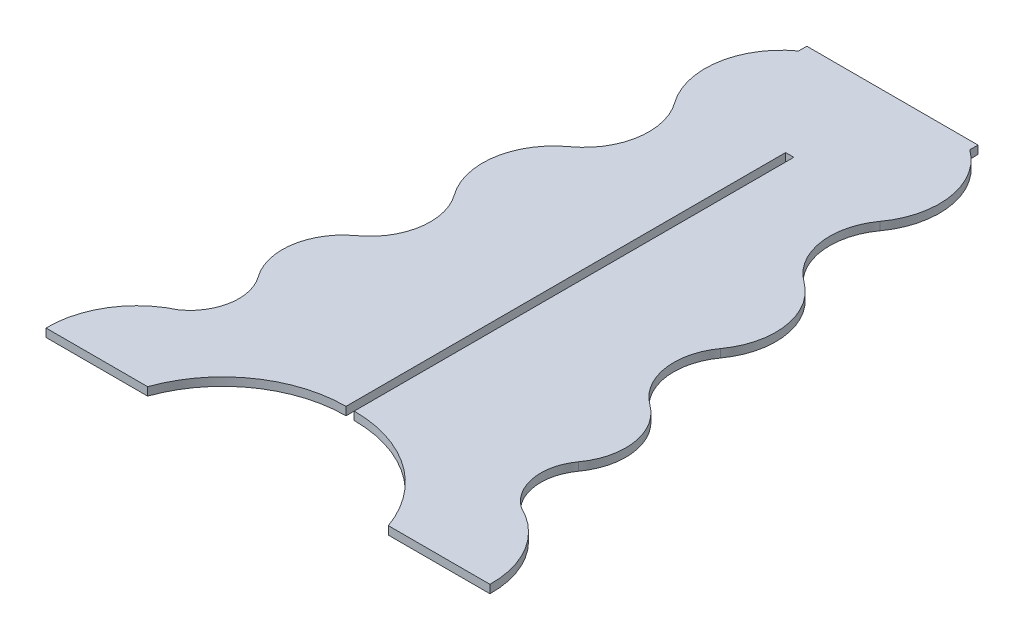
from build123d import *

# Parameters (mm, degrees)
BOSS_EXTRUDE1_DEPTH = 12


with BuildPart() as part:
    # Sketch1 → Boss-Extrude1 (new body)
    with BuildSketch(Plane(origin=(0, 0, 0), x_dir=(1, 0, 0), z_dir=(0, 1, 0))):
        with BuildLine():
            Line((6, 0), (6, 642))
            Line((6, 642), (-6, 642))
            Line((-6, 642), (-6, 0))
            ThreePointArc((-6, 0), (-109.965275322, -33.02760149), (-175.809051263, -120))
            Line((-175.809051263, -120), (-324.190948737, -120))
            ThreePointArc((-324.190948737, -120), (-304.755055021, -49.081824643), (-250, 0))
            ThreePointArc((-250, 0), (-221.324076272, 46.603663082), (-234.00090234, 99.8343694))
            ThreePointArc((-234.00090234, 99.8343694), (-249.721494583, 165.84602124), (-214.160345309, 223.639445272))
            ThreePointArc((-214.160345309, 223.639445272), (-178.815924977, 281.080644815), (-194.4407074, 346.689985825))
            ThreePointArc((-194.4407074, 346.689985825), (-212.852125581, 424.000567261), (-171.204127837, 491.686242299))
            ThreePointArc((-171.204127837, 491.686242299), (-133.187323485, 553.470558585), (-149.993492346, 624.040607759))
            ThreePointArc((-149.993492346, 624.040607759), (-169.796993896, 707.19662563), (-125, 780))
            Line((-125, 780), (-125, 792))
            Line((-125, 792), (125, 792))
            Line((125, 792), (125, 780))
            ThreePointArc((125, 780), (169.796993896, 707.19662563), (149.993492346, 624.040607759))
            ThreePointArc((149.993492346, 624.040607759), (133.187323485, 553.470558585), (171.204127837, 491.686242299))
            ThreePointArc((171.204127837, 491.686242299), (212.852125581, 424.000567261), (194.4407074, 346.689985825))
            ThreePointArc((194.4407074, 346.689985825), (178.815924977, 281.080644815), (214.160345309, 223.639445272))
            ThreePointArc((214.160345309, 223.639445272), (249.721494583, 165.84602124), (234.00090234, 99.8343694))
            ThreePointArc((234.00090234, 99.8343694), (221.324076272, 46.603663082), (250, 0))
            ThreePointArc((250, 0), (304.755055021, -49.081824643), (324.190948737, -120))
            Line((324.190948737, -120), (175.809051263, -120))
            ThreePointArc((175.809051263, -120), (109.965275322, -33.02760149), (6, 0))
        make_face()
    extrude(amount=BOSS_EXTRUDE1_DEPTH)


solid = part.part
